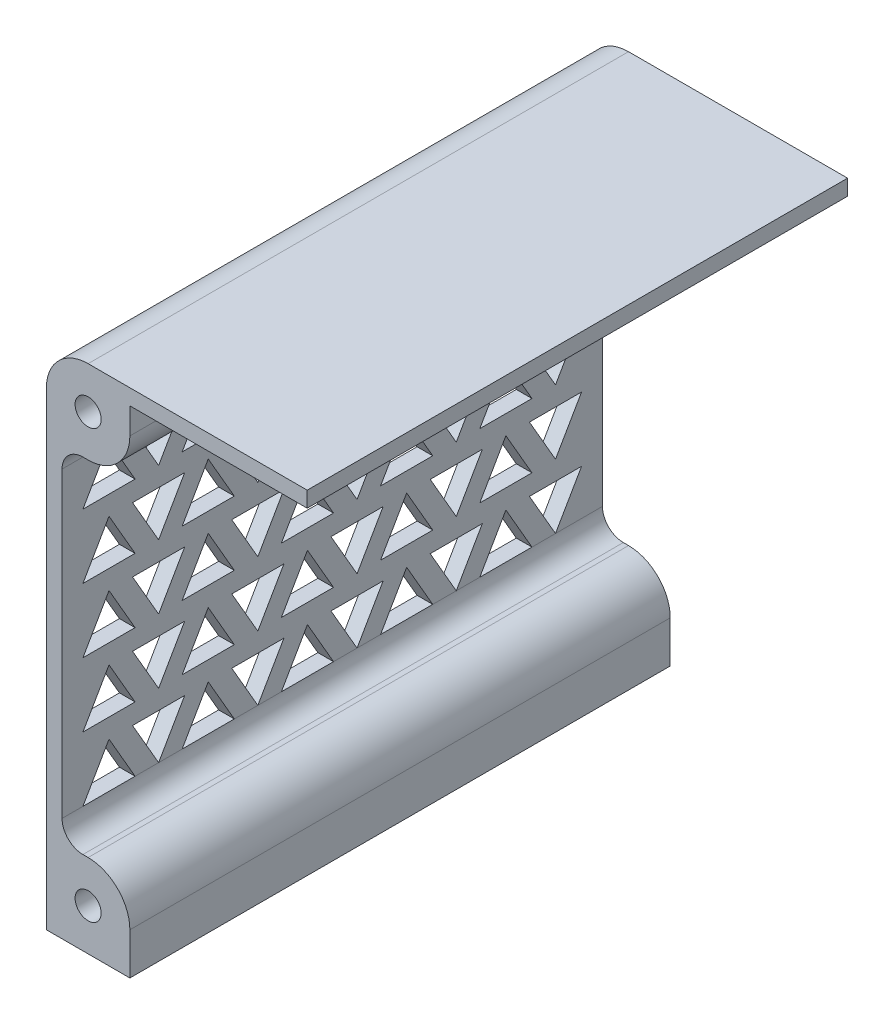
from build123d import *

# Parameters (mm, degrees)
SKETCH1_R           = 1.25
BOSS_EXTRUDE1_DEPTH = 51.8
FILLET1_R           = 2
CUT_EXTRUDE1_DEPTH  = 76.076560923
BOSS_EXTRUDE2_START = -36.8
SKETCH4_R           = 1.25
BOSS_EXTRUDE2_DEPTH = 21.8
FILLET3_R           = 4


with BuildPart() as part:
    # Sketch1 → Boss-Extrude1 (new body)
    with BuildSketch(Plane.XY):
        with BuildLine():
            Line((0, 0), (0, 49))
            Line((0, 49), (25, 49))
            Line((25, 49), (25, 47.5))
            Line((25, 47.5), (8, 47.5))
            Line((8, 47.5), (8, 45))
            ThreePointArc((8, 45), (6.828427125, 42.171572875), (4, 41))
            Line((4, 41), (1.5, 41))
            Line((1.5, 41), (1.5, 8))
            Line((1.5, 8), (4, 8))
            ThreePointArc((4, 8), (6.828427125, 6.828427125), (8, 4))
            Line((8, 4), (8, 0))
            Line((8, 0), (0, 0))
        make_face()
        with Locations(Location((4, 45, 0), (0, 0, 180))):
            Circle(SKETCH1_R, mode=Mode.SUBTRACT)
        with Locations(Location((4, 4, 0), (0, 0, 180))):
            Circle(SKETCH1_R, mode=Mode.SUBTRACT)
    extrude(amount=BOSS_EXTRUDE1_DEPTH)

    # Fillet1
    fillet1_edges = [part.edges().sort_by_distance(p)[0] for p in [
        (1.5, 41, 25.9),
        (1.5, 8, 25.9),
    ]]
    fillet(fillet1_edges, radius=FILLET1_R)

    # Sketch2 → Cut-Extrude1 (cut, through all)
    with BuildSketch(Plane(origin=(1.5, 0, 0), x_dir=(0, 0, -1), z_dir=(1, 0, 0))):
        Polygon((-47.3, 39), (-49.8, 34.669872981), (-44.8, 34.669872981), align=None)
        Polygon((-42.544444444, 34.669872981), (-45.044444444, 39), (-40.044444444, 39), align=None)
        Polygon((-37.788888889, 39), (-40.288888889, 34.669872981), (-35.288888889, 34.669872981), align=None)
        Polygon((-33.033333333, 34.669872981), (-35.533333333, 39), (-30.533333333, 39), align=None)
        Polygon((-28.277777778, 39), (-30.777777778, 34.669872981), (-25.777777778, 34.669872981), align=None)
        Polygon((-23.522222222, 34.669872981), (-26.022222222, 39), (-21.022222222, 39), align=None)
        Polygon((-18.766666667, 39), (-21.266666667, 34.669872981), (-16.266666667, 34.669872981), align=None)
        Polygon((-14.011111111, 34.669872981), (-16.511111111, 39), (-11.511111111, 39), align=None)
        Polygon((-9.255555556, 39), (-11.755555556, 34.669872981), (-6.755555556, 34.669872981), align=None)
        Polygon((-4.5, 34.669872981), (-7, 39), (-2, 39), align=None)
        Polygon((-47.3, 32.832531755), (-49.8, 28.502404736), (-44.8, 28.502404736), align=None)
        Polygon((-42.544444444, 28.502404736), (-45.044444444, 32.832531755), (-40.044444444, 32.832531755), align=None)
        Polygon((-37.788888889, 32.832531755), (-40.288888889, 28.502404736), (-35.288888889, 28.502404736), align=None)
        Polygon((-33.033333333, 28.502404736), (-35.533333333, 32.832531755), (-30.533333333, 32.832531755), align=None)
        Polygon((-28.277777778, 32.832531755), (-30.777777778, 28.502404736), (-25.777777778, 28.502404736), align=None)
        Polygon((-23.522222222, 28.502404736), (-26.022222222, 32.832531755), (-21.022222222, 32.832531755), align=None)
        Polygon((-18.766666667, 32.832531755), (-21.266666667, 28.502404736), (-16.266666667, 28.502404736), align=None)
        Polygon((-14.011111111, 28.502404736), (-16.511111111, 32.832531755), (-11.511111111, 32.832531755), align=None)
        Polygon((-9.255555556, 32.832531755), (-11.755555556, 28.502404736), (-6.755555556, 28.502404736), align=None)
        Polygon((-4.5, 28.502404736), (-7, 32.832531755), (-2, 32.832531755), align=None)
        Polygon((-47.3, 26.665063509), (-49.8, 22.334936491), (-44.8, 22.334936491), align=None)
        Polygon((-42.544444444, 22.334936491), (-45.044444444, 26.665063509), (-40.044444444, 26.665063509), align=None)
        Polygon((-37.788888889, 26.665063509), (-40.288888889, 22.334936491), (-35.288888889, 22.334936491), align=None)
        Polygon((-33.033333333, 22.334936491), (-35.533333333, 26.665063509), (-30.533333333, 26.665063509), align=None)
        Polygon((-28.277777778, 26.665063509), (-30.777777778, 22.334936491), (-25.777777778, 22.334936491), align=None)
        Polygon((-23.522222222, 22.334936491), (-26.022222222, 26.665063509), (-21.022222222, 26.665063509), align=None)
        Polygon((-18.766666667, 26.665063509), (-21.266666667, 22.334936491), (-16.266666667, 22.334936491), align=None)
        Polygon((-14.011111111, 22.334936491), (-16.511111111, 26.665063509), (-11.511111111, 26.665063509), align=None)
        Polygon((-9.255555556, 26.665063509), (-11.755555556, 22.334936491), (-6.755555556, 22.334936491), align=None)
        Polygon((-4.5, 22.334936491), (-7, 26.665063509), (-2, 26.665063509), align=None)
        Polygon((-47.3, 20.497595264), (-49.8, 16.167468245), (-44.8, 16.167468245), align=None)
        Polygon((-42.544444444, 16.167468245), (-45.044444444, 20.497595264), (-40.044444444, 20.497595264), align=None)
        Polygon((-37.788888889, 20.497595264), (-40.288888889, 16.167468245), (-35.288888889, 16.167468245), align=None)
        Polygon((-33.033333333, 16.167468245), (-35.533333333, 20.497595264), (-30.533333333, 20.497595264), align=None)
        Polygon((-28.277777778, 20.497595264), (-30.777777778, 16.167468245), (-25.777777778, 16.167468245), align=None)
        Polygon((-23.522222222, 16.167468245), (-26.022222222, 20.497595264), (-21.022222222, 20.497595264), align=None)
        Polygon((-18.766666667, 20.497595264), (-21.266666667, 16.167468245), (-16.266666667, 16.167468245), align=None)
        Polygon((-14.011111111, 16.167468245), (-16.511111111, 20.497595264), (-11.511111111, 20.497595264), align=None)
        Polygon((-9.255555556, 20.497595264), (-11.755555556, 16.167468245), (-6.755555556, 16.167468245), align=None)
        Polygon((-4.5, 16.167468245), (-7, 20.497595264), (-2, 20.497595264), align=None)
        Polygon((-47.3, 14.330127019), (-49.8, 10), (-44.8, 10), align=None)
        Polygon((-42.544444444, 10), (-45.044444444, 14.330127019), (-40.044444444, 14.330127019), align=None)
        Polygon((-37.788888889, 14.330127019), (-40.288888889, 10), (-35.288888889, 10), align=None)
        Polygon((-33.033333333, 10), (-35.533333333, 14.330127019), (-30.533333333, 14.330127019), align=None)
        Polygon((-28.277777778, 14.330127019), (-30.777777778, 10), (-25.777777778, 10), align=None)
        Polygon((-23.522222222, 10), (-26.022222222, 14.330127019), (-21.022222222, 14.330127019), align=None)
        Polygon((-18.766666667, 14.330127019), (-21.266666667, 10), (-16.266666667, 10), align=None)
        Polygon((-14.011111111, 10), (-16.511111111, 14.330127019), (-11.511111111, 14.330127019), align=None)
        Polygon((-9.255555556, 14.330127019), (-11.755555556, 10), (-6.755555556, 10), align=None)
        Polygon((-4.5, 10), (-7, 14.330127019), (-2, 14.330127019), align=None)
    extrude(amount=-CUT_EXTRUDE1_DEPTH, mode=Mode.SUBTRACT)

    # Sketch4 → Boss-Extrude2 (add)
    with BuildSketch(Plane.XY.offset(51.8).offset(BOSS_EXTRUDE2_START)):
        with Locations(Location((4, 4, 0), (0, 0, 180))):
            Circle(SKETCH4_R)
    extrude(amount=BOSS_EXTRUDE2_DEPTH)

    # Fillet3
    fillet3_edges = [part.edges().sort_by_distance(p)[0] for p in [
        (0, 49, 25.9),
    ]]
    fillet(fillet3_edges, radius=FILLET3_R)


solid = part.part
